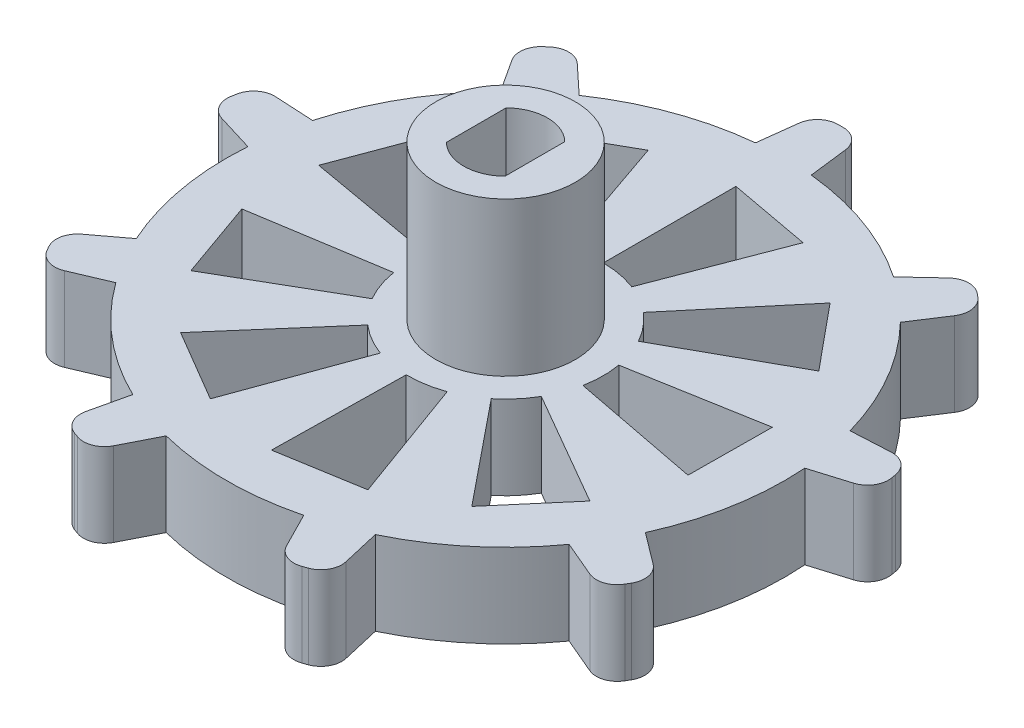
from build123d import *

# Parameters (mm, degrees)
ESBO_O1_R                = 3
RESSALTO_EXTRUS_O1_DEPTH = 6
ESBO_O2_R                = 5
RESSALTO_EXTRUS_O3_DEPTH = 11
FILETE1_R                = 1.5
FILETE2_R                = 1.5
FILETE3_R                = 1.5
FILETE4_R                = 1.5
FILETE5_R                = 1.5
FILETE6_R                = 1.5
FILETE7_R                = 1.5
FILETE8_R                = 1.5
FILETE9_R                = 1.5
FILETE10_R               = 1.5
FILETE11_R               = 1.5
FILETE12_R               = 1.5
FILETE13_R               = 1.5
FILETE14_R               = 1.5
FILETE15_R               = 1.5
FILETE16_R               = 1.5
FILETE17_R               = 1.5
FILETE18_R               = 1.5


with BuildPart() as part:
    # Esbo_o1 → Ressalto-extrus_o1 (new body)
    with BuildSketch(Plane(origin=(0, 0, 0), x_dir=(1, 0, 0), z_dir=(0, 1, 0))):
        with BuildLine():
            Line((-6.522081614, 25.594286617), (-8.022081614, 25.594286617))
            Line((-8.022081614, 25.594286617), (-8.5098566, 21.594286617))
            Line((-8.5098566, 21.594286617), (-8.522081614, 21.494035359))
            ThreePointArc((-8.522081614, 21.494035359), (-13.36248448, 20.388139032), (-17.781304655, 18.123953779))
            Line((-17.781304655, 18.123953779), (-20.799917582, 20.943534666))
            Line((-20.799917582, 20.943534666), (-23.098050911, 19.015171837))
            Line((-23.098050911, 19.015171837), (-20.845482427, 15.552803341))
            ThreePointArc((-20.845482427, 15.552803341), (-23.842589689, 11.594286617), (-25.772212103, 7.019457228))
            Line((-25.772212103, 7.019457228), (-29.89699542, 7.23905451))
            Line((-29.89699542, 7.23905451), (-30.417939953, 4.284631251))
            Line((-30.417939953, 4.284631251), (-26.466804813, 3.080226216))
            ThreePointArc((-26.466804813, 3.080226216), (-26.218236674, -1.878676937), (-24.755769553, -6.623536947))
            Line((-24.755769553, -6.623536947), (-28.056691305, -9.106675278))
            Line((-28.056691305, -9.106675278), (-26.556691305, -11.704751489))
            Line((-26.556691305, -11.704751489), (-22.755769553, -10.087638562))
            ThreePointArc((-22.755769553, -10.087638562), (-19.377833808, -13.726602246), (-15.207581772, -16.421320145))
            Line((-15.207581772, -16.421320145), (-16.140103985, -20.445306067))
            Line((-16.140103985, -20.445306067), (-13.321026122, -21.471366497))
            Line((-13.321026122, -21.471366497), (-11.448811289, -17.789400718))
            ThreePointArc((-11.448811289, -17.789400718), (-6.522081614, -18.405713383), (-1.595351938, -17.789400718))
            Line((-1.595351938, -17.789400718), (0.276862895, -21.471366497))
            Line((0.276862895, -21.471366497), (3.095940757, -20.445306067))
            Line((3.095940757, -20.445306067), (2.163418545, -16.421320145))
            ThreePointArc((2.163418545, -16.421320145), (6.33367058, -13.726602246), (9.711606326, -10.087638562))
            Line((9.711606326, -10.087638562), (13.512528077, -11.704751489))
            Line((13.512528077, -11.704751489), (15.012528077, -9.106675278))
            Line((15.012528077, -9.106675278), (11.711606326, -6.623536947))
            ThreePointArc((11.711606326, -6.623536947), (13.174073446, -1.878676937), (13.422641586, 3.080226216))
            Line((13.422641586, 3.080226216), (17.373776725, 4.284631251))
            Line((17.373776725, 4.284631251), (16.852832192, 7.23905451))
            Line((16.852832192, 7.23905451), (12.728048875, 7.019457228))
            ThreePointArc((12.728048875, 7.019457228), (10.798426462, 11.594286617), (7.8013192, 15.552803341))
            Line((7.8013192, 15.552803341), (10.053887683, 19.015171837))
            Line((10.053887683, 19.015171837), (7.755754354, 20.943534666))
            Line((7.755754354, 20.943534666), (4.737141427, 18.123953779))
            ThreePointArc((4.737141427, 18.123953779), (0.318321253, 20.388139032), (-4.522081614, 21.494035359))
            Line((-4.522081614, 21.494035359), (-4.534306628, 21.594286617))
            Line((-4.534306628, 21.594286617), (-5.022081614, 25.594286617))
            Line((-5.022081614, 25.594286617), (-6.522081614, 25.594286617))
        make_face()
        with BuildLine():
            ThreePointArc((-11.110008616, -3.692576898), (-10.072289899, -4.438624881), (-8.916222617, -4.983561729))
            Line((-8.916222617, -4.983561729), (-12.165413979, -13.910641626))
            Line((-12.165413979, -13.910641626), (-17.336480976, -10.867605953))
            Line((-17.336480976, -10.867605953), (-11.110008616, -3.692576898))
        make_face(mode=Mode.SUBTRACT)
        with BuildLine():
            ThreePointArc((-13.434967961, 0.493376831), (-13.119579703, -0.745161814), (-12.58425944, -1.905713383))
            Line((-12.58425944, -1.905713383), (-20.811500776, -6.655713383))
            Line((-20.811500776, -6.655713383), (-22.816742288, -1.000715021))
            Line((-22.816742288, -1.000715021), (-13.434967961, 0.493376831))
        make_face(mode=Mode.SUBTRACT)
        with Locations(Location((-6.522081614, 1.594286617, 0), (0, 0, 270))):
            Circle(ESBO_O1_R, mode=Mode.SUBTRACT)
        with BuildLine():
            ThreePointArc((-6.638307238, -5.404748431), (-5.363818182, -5.309221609), (-4.127940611, -4.983561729))
            Line((-4.127940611, -4.983561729), (-0.878749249, -13.910641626))
            Line((-0.878749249, -13.910641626), (-6.796042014, -14.903438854))
            Line((-6.796042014, -14.903438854), (-6.638307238, -5.404748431))
        make_face(mode=Mode.SUBTRACT)
        with BuildLine():
            ThreePointArc((-2.112222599, -3.84199368), (-1.197310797, -2.949590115), (-0.459903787, -1.905713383))
            Line((-0.459903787, -1.905713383), (7.767337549, -6.655713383))
            Line((7.767337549, -6.655713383), (3.872586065, -11.219802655))
            Line((3.872586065, -11.219802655), (-2.112222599, -3.84199368))
        make_face(mode=Mode.SUBTRACT)
        with BuildLine():
            ThreePointArc((0.350439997, 0.264457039), (0.477677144, 1.536171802), (0.371572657, 2.80982386))
            Line((0.371572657, 2.80982386), (9.727246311, 4.459481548))
            Line((9.727246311, 4.459481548), (9.677433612, -1.540311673))
            Line((9.677433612, -1.540311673), (0.350439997, 0.264457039))
        make_face(mode=Mode.SUBTRACT)
        with BuildLine():
            ThreePointArc((-12.525310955, 5.194458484), (-13.079826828, 4.042955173), (-13.415735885, 2.80982386))
            Line((-13.415735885, 2.80982386), (-22.771409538, 4.459481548))
            Line((-22.771409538, 4.459481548), (-20.672550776, 10.080406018))
            Line((-20.672550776, 10.080406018), (-12.525310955, 5.194458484))
        make_face(mode=Mode.SUBTRACT)
        with BuildLine():
            ThreePointArc((-8.806676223, 8.210979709), (-9.971632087, 7.685312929), (-11.021594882, 6.956597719))
            Line((-11.021594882, 6.956597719), (-17.128077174, 14.234019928))
            Line((-17.128077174, 14.234019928), (-11.907197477, 17.190777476))
            Line((-11.907197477, 17.190777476), (-8.806676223, 8.210979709))
        make_face(mode=Mode.SUBTRACT)
        with BuildLine():
            ThreePointArc((-4.019054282, 8.131476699), (-5.249354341, 8.477611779), (-6.522081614, 8.594286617))
            Line((-6.522081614, 8.594286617), (-6.522081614, 18.094286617))
            Line((-6.522081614, 18.094286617), (-0.622088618, 17.003377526))
            Line((-0.622088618, 17.003377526), (-4.019054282, 8.131476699))
        make_face(mode=Mode.SUBTRACT)
        with BuildLine():
            ThreePointArc((-0.402626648, 4.993149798), (-1.122599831, 6.049126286), (-2.022568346, 6.956597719))
            Line((-2.022568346, 6.956597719), (4.083913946, 14.234019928))
            Line((4.083913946, 14.234019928), (7.902347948, 9.605892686))
            Line((7.902347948, 9.605892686), (-0.402626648, 4.993149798))
        make_face(mode=Mode.SUBTRACT)
    extrude(amount=RESSALTO_EXTRUS_O1_DEPTH)

    # Esbo_o2 → Ressalto-extrus_o3 (add)
    with BuildSketch(Plane(origin=(0, 6, 0), x_dir=(1, 0, 0), z_dir=(0, 1, 0))):
        with Locations(Location((-6.522081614, 1.594286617, 0), (0, 0, 270))):
            Circle(ESBO_O2_R)
        with BuildLine():
            Line((-8.622081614, 3.736715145), (-8.622081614, -0.548141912))
            ThreePointArc((-8.622081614, -0.548141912), (-6.522081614, -1.405713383), (-4.422081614, -0.548141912))
            Line((-4.422081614, -0.548141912), (-4.422081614, 3.736715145))
            ThreePointArc((-4.422081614, 3.736715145), (-6.522081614, 4.594286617), (-8.622081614, 3.736715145))
        make_face(mode=Mode.SUBTRACT)
    extrude(amount=RESSALTO_EXTRUS_O3_DEPTH)

    # Filete1
    filete1_edges = [part.edges().sort_by_distance(p)[0] for p in [
        (-13.321026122, 3, 21.471366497),
    ]]
    fillet(filete1_edges, radius=FILETE1_R)

    # Filete2
    filete2_edges = [part.edges().sort_by_distance(p)[0] for p in [
        (-16.140103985, 3, 20.445306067),
    ]]
    fillet(filete2_edges, radius=FILETE2_R)

    # Filete3
    filete3_edges = [part.edges().sort_by_distance(p)[0] for p in [
        (-26.556691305, 3, 11.704751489),
    ]]
    fillet(filete3_edges, radius=FILETE3_R)

    # Filete4
    filete4_edges = [part.edges().sort_by_distance(p)[0] for p in [
        (-28.056691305, 3, 9.106675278),
    ]]
    fillet(filete4_edges, radius=FILETE4_R)

    # Filete5
    filete5_edges = [part.edges().sort_by_distance(p)[0] for p in [
        (0.276862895, 3, 21.471366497),
    ]]
    fillet(filete5_edges, radius=FILETE5_R)

    # Filete6
    filete6_edges = [part.edges().sort_by_distance(p)[0] for p in [
        (3.095940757, 3, 20.445306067),
    ]]
    fillet(filete6_edges, radius=FILETE6_R)

    # Filete7
    filete7_edges = [part.edges().sort_by_distance(p)[0] for p in [
        (13.512528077, 3, 11.704751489),
    ]]
    fillet(filete7_edges, radius=FILETE7_R)

    # Filete8
    filete8_edges = [part.edges().sort_by_distance(p)[0] for p in [
        (15.012528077, 3, 9.106675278),
    ]]
    fillet(filete8_edges, radius=FILETE8_R)

    # Filete9
    filete9_edges = [part.edges().sort_by_distance(p)[0] for p in [
        (17.373776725, 3, -4.284631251),
    ]]
    fillet(filete9_edges, radius=FILETE9_R)

    # Filete10
    filete10_edges = [part.edges().sort_by_distance(p)[0] for p in [
        (16.852832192, 3, -7.23905451),
    ]]
    fillet(filete10_edges, radius=FILETE10_R)

    # Filete11
    filete11_edges = [part.edges().sort_by_distance(p)[0] for p in [
        (10.053887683, 3, -19.015171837),
    ]]
    fillet(filete11_edges, radius=FILETE11_R)

    # Filete12
    filete12_edges = [part.edges().sort_by_distance(p)[0] for p in [
        (7.755754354, 3, -20.943534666),
    ]]
    fillet(filete12_edges, radius=FILETE12_R)

    # Filete13
    filete13_edges = [part.edges().sort_by_distance(p)[0] for p in [
        (-5.022081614, 3, -25.594286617),
    ]]
    fillet(filete13_edges, radius=FILETE13_R)

    # Filete14
    filete14_edges = [part.edges().sort_by_distance(p)[0] for p in [
        (-8.022081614, 3, -25.594286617),
    ]]
    fillet(filete14_edges, radius=FILETE14_R)

    # Filete15
    filete15_edges = [part.edges().sort_by_distance(p)[0] for p in [
        (-20.799917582, 3, -20.943534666),
    ]]
    fillet(filete15_edges, radius=FILETE15_R)

    # Filete16
    filete16_edges = [part.edges().sort_by_distance(p)[0] for p in [
        (-23.098050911, 3, -19.015171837),
    ]]
    fillet(filete16_edges, radius=FILETE16_R)

    # Filete17
    filete17_edges = [part.edges().sort_by_distance(p)[0] for p in [
        (-29.89699542, 3, -7.23905451),
    ]]
    fillet(filete17_edges, radius=FILETE17_R)

    # Filete18
    filete18_edges = [part.edges().sort_by_distance(p)[0] for p in [
        (-30.417939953, 3, -4.284631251),
    ]]
    fillet(filete18_edges, radius=FILETE18_R)


solid = part.part
